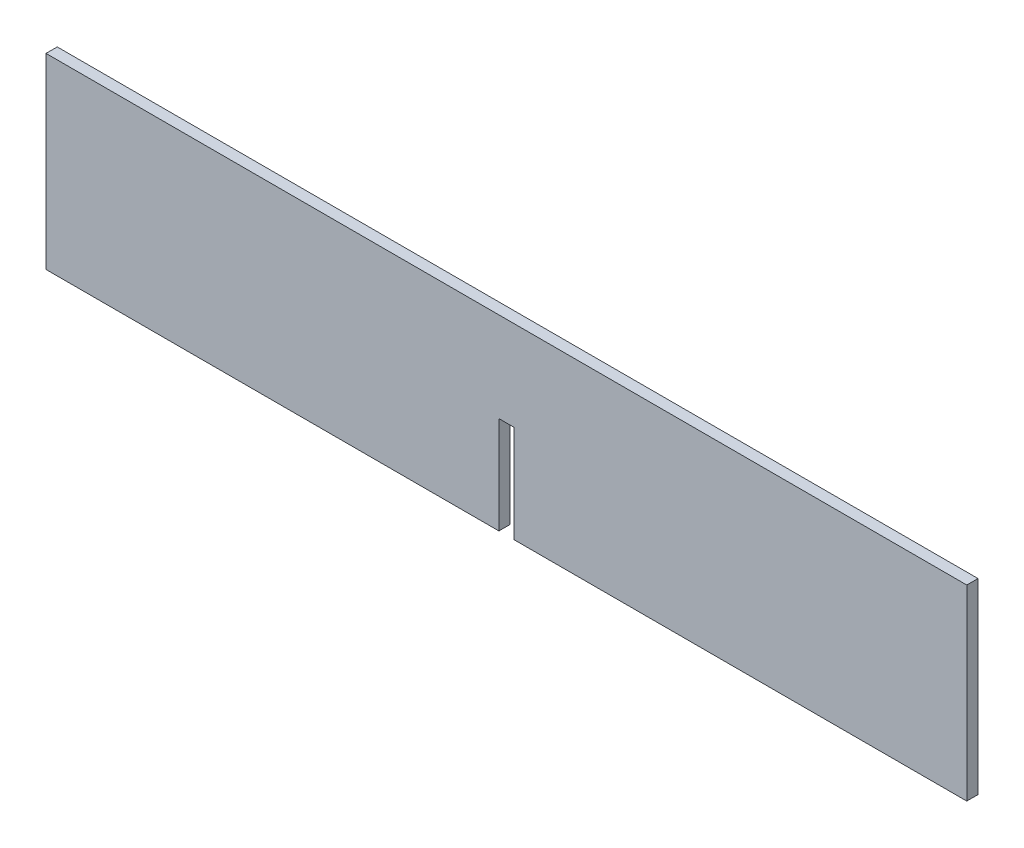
ISO-10303-21;
HEADER;
FILE_DESCRIPTION(('STEP AP214'),'2;1');
FILE_NAME('part.step','',(''),(''),'','','');
FILE_SCHEMA(('AUTOMOTIVE_DESIGN { 1 0 10303 214 1 1 1 1 }'));
ENDSEC;
DATA;
#1=APPLICATION_CONTEXT('core data for automotive mechanical design processes');
#2=APPLICATION_PROTOCOL_DEFINITION('international standard','automotive_design',2000,#1);
#3=PRODUCT_CONTEXT('',#1,'mechanical');
#4=PRODUCT('Part','Part','',(#3));
#5=PRODUCT_RELATED_PRODUCT_CATEGORY('part','',(#4));
#6=PRODUCT_DEFINITION_FORMATION('','',#4);
#7=PRODUCT_DEFINITION_CONTEXT('part definition',#1,'design');
#8=PRODUCT_DEFINITION('design','',#6,#7);
#9=PRODUCT_DEFINITION_SHAPE('','',#8);
#10=(LENGTH_UNIT() NAMED_UNIT(*) SI_UNIT(.MILLI.,.METRE.));
#11=(NAMED_UNIT(*) PLANE_ANGLE_UNIT() SI_UNIT($,.RADIAN.));
#12=(NAMED_UNIT(*) SI_UNIT($,.STERADIAN.) SOLID_ANGLE_UNIT());
#13=UNCERTAINTY_MEASURE_WITH_UNIT(LENGTH_MEASURE(1.E-05),#10,'distance_accuracy_value','');
#14=(GEOMETRIC_REPRESENTATION_CONTEXT(3) GLOBAL_UNCERTAINTY_ASSIGNED_CONTEXT((#13)) GLOBAL_UNIT_ASSIGNED_CONTEXT((#10,
#11,#12)) REPRESENTATION_CONTEXT('',''));
#15=CARTESIAN_POINT('',(0.,0.,0.));
#16=DIRECTION('',(0.,0.,1.));
#17=DIRECTION('',(1.,0.,0.));
#18=AXIS2_PLACEMENT_3D('',#15,#16,#17);
#19=CARTESIAN_POINT('',(-123.,-25.,3.));
#20=DIRECTION('',(0.,1.,0.));
#21=DIRECTION('',(0.,0.,1.));
#22=AXIS2_PLACEMENT_3D('',#19,#20,#21);
#23=PLANE('',#22);
#24=DIRECTION('',(1.,0.,0.));
#25=VECTOR('',#24,1.);
#26=CARTESIAN_POINT('',(-123.,-25.,0.));
#27=LINE('',#26,#25);
#28=CARTESIAN_POINT('',(-123.,-25.,0.));
#29=VERTEX_POINT('',#28);
#30=CARTESIAN_POINT('',(-2.,-25.,0.));
#31=VERTEX_POINT('',#30);
#32=EDGE_CURVE('E122',#29,#31,#27,.T.);
#33=ORIENTED_EDGE('',*,*,#32,.T.);
#34=DIRECTION('',(0.,0.,1.));
#35=VECTOR('',#34,1.);
#36=CARTESIAN_POINT('',(-2.,-25.,0.));
#37=LINE('',#36,#35);
#38=CARTESIAN_POINT('',(-2.,-25.,3.));
#39=VERTEX_POINT('',#38);
#40=EDGE_CURVE('E110',#31,#39,#37,.T.);
#41=ORIENTED_EDGE('',*,*,#40,.T.);
#42=DIRECTION('',(1.,0.,0.));
#43=VECTOR('',#42,1.);
#44=CARTESIAN_POINT('',(-123.,-25.,3.));
#45=LINE('',#44,#43);
#46=CARTESIAN_POINT('',(-123.,-25.,3.));
#47=VERTEX_POINT('',#46);
#48=EDGE_CURVE('E88',#47,#39,#45,.T.);
#49=ORIENTED_EDGE('',*,*,#48,.F.);
#50=DIRECTION('',(0.,0.,-1.));
#51=VECTOR('',#50,1.);
#52=CARTESIAN_POINT('',(-123.,-25.,3.));
#53=LINE('',#52,#51);
#54=EDGE_CURVE('E11',#47,#29,#53,.T.);
#55=ORIENTED_EDGE('',*,*,#54,.T.);
#56=EDGE_LOOP('',(#33,#41,#49,#55));
#57=FACE_BOUND('',#56,.T.);
#58=ADVANCED_FACE('F36',(#57),#23,.F.);
#59=CARTESIAN_POINT('',(-123.,25.,3.));
#60=DIRECTION('',(1.,0.,0.));
#61=DIRECTION('',(0.,0.,-1.));
#62=AXIS2_PLACEMENT_3D('',#59,#60,#61);
#63=PLANE('',#62);
#64=DIRECTION('',(0.,-1.,0.));
#65=VECTOR('',#64,1.);
#66=CARTESIAN_POINT('',(-123.,25.,0.));
#67=LINE('',#66,#65);
#68=CARTESIAN_POINT('',(-123.,25.,0.));
#69=VERTEX_POINT('',#68);
#70=EDGE_CURVE('E133',#69,#29,#67,.T.);
#71=ORIENTED_EDGE('',*,*,#70,.T.);
#72=ORIENTED_EDGE('',*,*,#54,.F.);
#73=DIRECTION('',(0.,-1.,0.));
#74=VECTOR('',#73,1.);
#75=CARTESIAN_POINT('',(-123.,25.,3.));
#76=LINE('',#75,#74);
#77=CARTESIAN_POINT('',(-123.,25.,3.));
#78=VERTEX_POINT('',#77);
#79=EDGE_CURVE('E138',#78,#47,#76,.T.);
#80=ORIENTED_EDGE('',*,*,#79,.F.);
#81=DIRECTION('',(0.,0.,-1.));
#82=VECTOR('',#81,1.);
#83=CARTESIAN_POINT('',(-123.,25.,3.));
#84=LINE('',#83,#82);
#85=EDGE_CURVE('E139',#78,#69,#84,.T.);
#86=ORIENTED_EDGE('',*,*,#85,.T.);
#87=EDGE_LOOP('',(#71,#72,#80,#86));
#88=FACE_BOUND('',#87,.T.);
#89=ADVANCED_FACE('F38',(#88),#63,.F.);
#90=CARTESIAN_POINT('',(2.00000000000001,-25.,3.));
#91=VERTEX_POINT('',#90);
#92=CARTESIAN_POINT('',(123.,-25.,3.));
#93=VERTEX_POINT('',#92);
#94=EDGE_CURVE('E164',#91,#93,#45,.T.);
#95=ORIENTED_EDGE('',*,*,#94,.F.);
#96=DIRECTION('',(0.,0.,1.));
#97=VECTOR('',#96,1.);
#98=CARTESIAN_POINT('',(2.00000000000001,-25.,0.));
#99=LINE('',#98,#97);
#100=CARTESIAN_POINT('',(2.00000000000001,-25.,0.));
#101=VERTEX_POINT('',#100);
#102=EDGE_CURVE('E117',#101,#91,#99,.T.);
#103=ORIENTED_EDGE('',*,*,#102,.F.);
#104=CARTESIAN_POINT('',(123.,-25.,0.));
#105=VERTEX_POINT('',#104);
#106=EDGE_CURVE('E130',#101,#105,#27,.T.);
#107=ORIENTED_EDGE('',*,*,#106,.T.);
#108=DIRECTION('',(0.,0.,-1.));
#109=VECTOR('',#108,1.);
#110=CARTESIAN_POINT('',(123.,-25.,3.));
#111=LINE('',#110,#109);
#112=EDGE_CURVE('E44',#93,#105,#111,.T.);
#113=ORIENTED_EDGE('',*,*,#112,.F.);
#114=EDGE_LOOP('',(#95,#103,#107,#113));
#115=FACE_BOUND('',#114,.T.);
#116=ADVANCED_FACE('F179',(#115),#23,.F.);
#117=CARTESIAN_POINT('',(123.,25.,3.));
#118=DIRECTION('',(-1.,0.,0.));
#119=DIRECTION('',(0.,0.,1.));
#120=AXIS2_PLACEMENT_3D('',#117,#118,#119);
#121=PLANE('',#120);
#122=DIRECTION('',(0.,1.,0.));
#123=VECTOR('',#122,1.);
#124=CARTESIAN_POINT('',(123.,25.,0.));
#125=LINE('',#124,#123);
#126=CARTESIAN_POINT('',(123.,25.,0.));
#127=VERTEX_POINT('',#126);
#128=EDGE_CURVE('E129',#105,#127,#125,.T.);
#129=ORIENTED_EDGE('',*,*,#128,.T.);
#130=DIRECTION('',(0.,0.,-1.));
#131=VECTOR('',#130,1.);
#132=CARTESIAN_POINT('',(123.,25.,3.));
#133=LINE('',#132,#131);
#134=CARTESIAN_POINT('',(123.,25.,3.));
#135=VERTEX_POINT('',#134);
#136=EDGE_CURVE('E141',#135,#127,#133,.T.);
#137=ORIENTED_EDGE('',*,*,#136,.F.);
#138=DIRECTION('',(0.,1.,0.));
#139=VECTOR('',#138,1.);
#140=CARTESIAN_POINT('',(123.,25.,3.));
#141=LINE('',#140,#139);
#142=EDGE_CURVE('E149',#93,#135,#141,.T.);
#143=ORIENTED_EDGE('',*,*,#142,.F.);
#144=ORIENTED_EDGE('',*,*,#112,.T.);
#145=EDGE_LOOP('',(#129,#137,#143,#144));
#146=FACE_BOUND('',#145,.T.);
#147=ADVANCED_FACE('F147',(#146),#121,.F.);
#148=CARTESIAN_POINT('',(-123.,25.,3.));
#149=DIRECTION('',(0.,-1.,0.));
#150=DIRECTION('',(0.,0.,-1.));
#151=AXIS2_PLACEMENT_3D('',#148,#149,#150);
#152=PLANE('',#151);
#153=DIRECTION('',(-1.,0.,0.));
#154=VECTOR('',#153,1.);
#155=CARTESIAN_POINT('',(-123.,25.,0.));
#156=LINE('',#155,#154);
#157=EDGE_CURVE('E81',#127,#69,#156,.T.);
#158=ORIENTED_EDGE('',*,*,#157,.T.);
#159=ORIENTED_EDGE('',*,*,#85,.F.);
#160=DIRECTION('',(-1.,0.,0.));
#161=VECTOR('',#160,1.);
#162=CARTESIAN_POINT('',(-123.,25.,3.));
#163=LINE('',#162,#161);
#164=EDGE_CURVE('E60',#135,#78,#163,.T.);
#165=ORIENTED_EDGE('',*,*,#164,.F.);
#166=ORIENTED_EDGE('',*,*,#136,.T.);
#167=EDGE_LOOP('',(#158,#159,#165,#166));
#168=FACE_BOUND('',#167,.T.);
#169=ADVANCED_FACE('F168',(#168),#152,.F.);
#170=CARTESIAN_POINT('',(-123.,-25.,3.));
#171=DIRECTION('',(0.,0.,1.));
#172=DIRECTION('',(1.,0.,0.));
#173=AXIS2_PLACEMENT_3D('',#170,#171,#172);
#174=PLANE('',#173);
#175=DIRECTION('',(0.,-1.,0.));
#176=VECTOR('',#175,1.);
#177=CARTESIAN_POINT('',(-2.,-25.,3.));
#178=LINE('',#177,#176);
#179=CARTESIAN_POINT('',(-2.,1.,3.));
#180=VERTEX_POINT('',#179);
#181=EDGE_CURVE('E115',#180,#39,#178,.T.);
#182=ORIENTED_EDGE('',*,*,#181,.F.);
#183=DIRECTION('',(-1.,0.,0.));
#184=VECTOR('',#183,1.);
#185=CARTESIAN_POINT('',(-2.,1.,3.));
#186=LINE('',#185,#184);
#187=CARTESIAN_POINT('',(2.,1.,3.));
#188=VERTEX_POINT('',#187);
#189=EDGE_CURVE('E125',#188,#180,#186,.T.);
#190=ORIENTED_EDGE('',*,*,#189,.F.);
#191=DIRECTION('',(0.,1.,0.));
#192=VECTOR('',#191,1.);
#193=CARTESIAN_POINT('',(2.00000000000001,-25.,3.));
#194=LINE('',#193,#192);
#195=EDGE_CURVE('E171',#91,#188,#194,.T.);
#196=ORIENTED_EDGE('',*,*,#195,.F.);
#197=ORIENTED_EDGE('',*,*,#94,.T.);
#198=ORIENTED_EDGE('',*,*,#142,.T.);
#199=ORIENTED_EDGE('',*,*,#164,.T.);
#200=ORIENTED_EDGE('',*,*,#79,.T.);
#201=ORIENTED_EDGE('',*,*,#48,.T.);
#202=EDGE_LOOP('',(#182,#190,#196,#197,#198,#199,#200,#201));
#203=FACE_BOUND('',#202,.T.);
#204=ADVANCED_FACE('F166',(#203),#174,.T.);
#205=CARTESIAN_POINT('',(-123.,-25.,0.));
#206=DIRECTION('',(0.,0.,1.));
#207=DIRECTION('',(1.,0.,0.));
#208=AXIS2_PLACEMENT_3D('',#205,#206,#207);
#209=PLANE('',#208);
#210=DIRECTION('',(-1.,0.,0.));
#211=VECTOR('',#210,1.);
#212=CARTESIAN_POINT('',(-2.,1.,0.));
#213=LINE('',#212,#211);
#214=CARTESIAN_POINT('',(1.99999999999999,0.999999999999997,0.));
#215=VERTEX_POINT('',#214);
#216=CARTESIAN_POINT('',(-2.,1.,0.));
#217=VERTEX_POINT('',#216);
#218=EDGE_CURVE('E51',#215,#217,#213,.T.);
#219=ORIENTED_EDGE('',*,*,#218,.T.);
#220=DIRECTION('',(0.,-1.,0.));
#221=VECTOR('',#220,1.);
#222=CARTESIAN_POINT('',(-2.,-25.,0.));
#223=LINE('',#222,#221);
#224=EDGE_CURVE('E113',#217,#31,#223,.T.);
#225=ORIENTED_EDGE('',*,*,#224,.T.);
#226=ORIENTED_EDGE('',*,*,#32,.F.);
#227=ORIENTED_EDGE('',*,*,#70,.F.);
#228=ORIENTED_EDGE('',*,*,#157,.F.);
#229=ORIENTED_EDGE('',*,*,#128,.F.);
#230=ORIENTED_EDGE('',*,*,#106,.F.);
#231=DIRECTION('',(0.,1.,0.));
#232=VECTOR('',#231,1.);
#233=CARTESIAN_POINT('',(2.00000000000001,-25.,0.));
#234=LINE('',#233,#232);
#235=EDGE_CURVE('E124',#101,#215,#234,.T.);
#236=ORIENTED_EDGE('',*,*,#235,.T.);
#237=EDGE_LOOP('',(#219,#225,#226,#227,#228,#229,#230,#236));
#238=FACE_BOUND('',#237,.T.);
#239=ADVANCED_FACE('F120',(#238),#209,.F.);
#240=CARTESIAN_POINT('',(-2.,-25.,0.));
#241=DIRECTION('',(-1.,0.,0.));
#242=DIRECTION('',(0.,-1.,0.));
#243=AXIS2_PLACEMENT_3D('',#240,#241,#242);
#244=PLANE('',#243);
#245=ORIENTED_EDGE('',*,*,#181,.T.);
#246=ORIENTED_EDGE('',*,*,#40,.F.);
#247=ORIENTED_EDGE('',*,*,#224,.F.);
#248=DIRECTION('',(0.,0.,1.));
#249=VECTOR('',#248,1.);
#250=CARTESIAN_POINT('',(-2.,1.,0.));
#251=LINE('',#250,#249);
#252=EDGE_CURVE('E154',#217,#180,#251,.T.);
#253=ORIENTED_EDGE('',*,*,#252,.T.);
#254=EDGE_LOOP('',(#245,#246,#247,#253));
#255=FACE_BOUND('',#254,.T.);
#256=ADVANCED_FACE('F112',(#255),#244,.F.);
#257=CARTESIAN_POINT('',(-2.,1.,0.));
#258=DIRECTION('',(0.,1.,0.));
#259=DIRECTION('',(-1.,0.,0.));
#260=AXIS2_PLACEMENT_3D('',#257,#258,#259);
#261=PLANE('',#260);
#262=ORIENTED_EDGE('',*,*,#189,.T.);
#263=ORIENTED_EDGE('',*,*,#252,.F.);
#264=ORIENTED_EDGE('',*,*,#218,.F.);
#265=DIRECTION('',(0.,0.,1.));
#266=VECTOR('',#265,1.);
#267=CARTESIAN_POINT('',(2.,1.,0.));
#268=LINE('',#267,#266);
#269=EDGE_CURVE('E155',#215,#188,#268,.T.);
#270=ORIENTED_EDGE('',*,*,#269,.T.);
#271=EDGE_LOOP('',(#262,#263,#264,#270));
#272=FACE_BOUND('',#271,.T.);
#273=ADVANCED_FACE('F231',(#272),#261,.F.);
#274=CARTESIAN_POINT('',(2.00000000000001,-25.,0.));
#275=DIRECTION('',(1.,0.,0.));
#276=DIRECTION('',(0.,1.,0.));
#277=AXIS2_PLACEMENT_3D('',#274,#275,#276);
#278=PLANE('',#277);
#279=ORIENTED_EDGE('',*,*,#195,.T.);
#280=ORIENTED_EDGE('',*,*,#269,.F.);
#281=ORIENTED_EDGE('',*,*,#235,.F.);
#282=ORIENTED_EDGE('',*,*,#102,.T.);
#283=EDGE_LOOP('',(#279,#280,#281,#282));
#284=FACE_BOUND('',#283,.T.);
#285=ADVANCED_FACE('F178',(#284),#278,.F.);
#286=CLOSED_SHELL('',(#58,#89,#116,#147,#169,#204,#239,#256,#273,#285));
#287=MANIFOLD_SOLID_BREP('B2',#286);
#288=ADVANCED_BREP_SHAPE_REPRESENTATION('',(#18,#287),#14);
#289=SHAPE_DEFINITION_REPRESENTATION(#9,#288);
ENDSEC;
END-ISO-10303-21;
